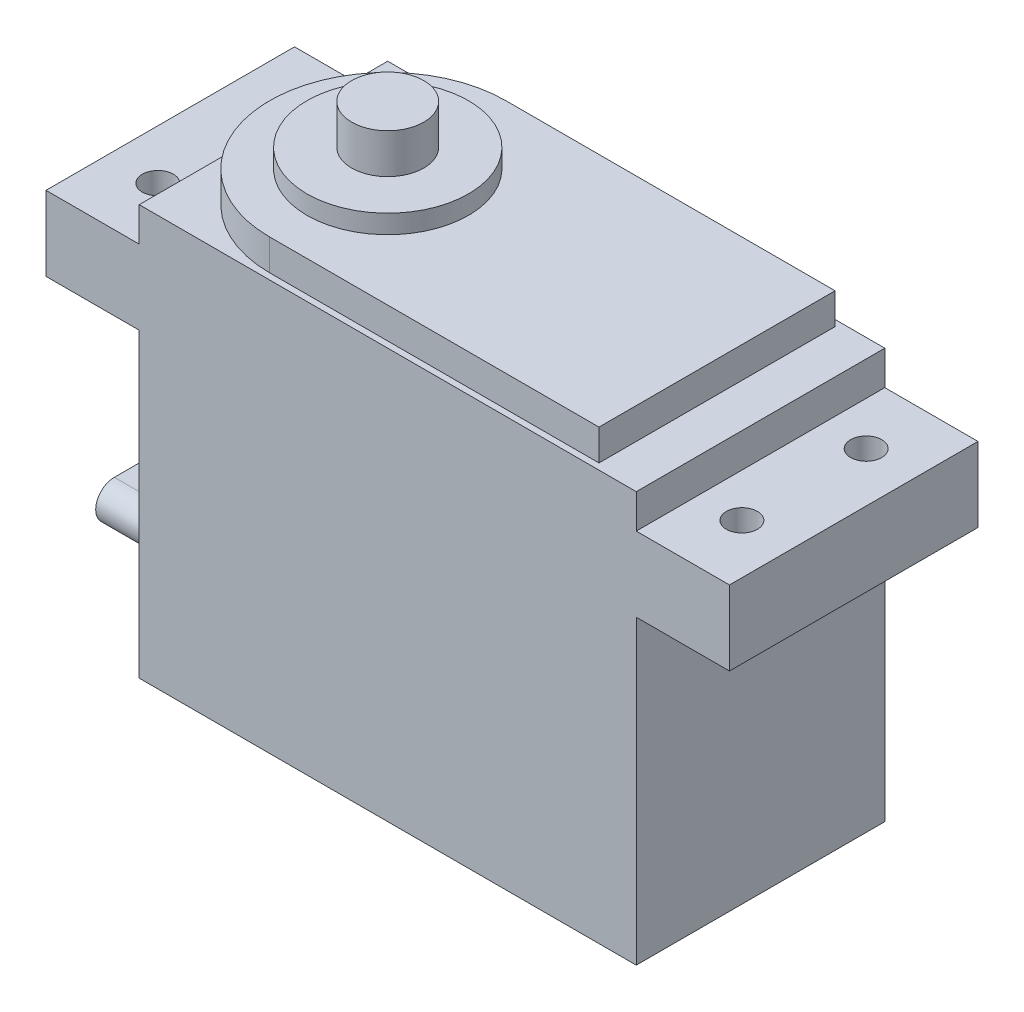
from build123d import *

# Parameters (mm, degrees)
EXTRUSION1_DEPTH        = 20
ESQUISSE2_R             = 1.25
ENL_V_MAT_EXTRU_1_DEPTH = 60.760459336
EXTRUSION2_DEPTH        = 2.5
ESQUISSE4_R             = 6.5
EXTRUSION3_DEPTH        = 1.5
ESQUISSE5_R             = 2.9
EXTRUSION4_DEPTH        = 3.2
EXTRUSION5_DEPTH        = 0.5
EXTRUSION6_DEPTH        = 10


with BuildPart() as part:
    # Esquisse1 → Extrusion1 (new body)
    with BuildSketch(Plane.XY):
        Polygon((47.5, 30.25), (40, 30.25), (40, 33), (0, 33), (0, 30.25), (-7.5, 30.25), (-7.5, 24.25), (0, 24.25), (0, 0), (40, 0), (40, 24.25), (47.5, 24.25), align=None)
    extrude(amount=EXTRUSION1_DEPTH)

    # Esquisse2 → Enl_v. mat.-Extru.1 (cut, through all)
    with BuildSketch(Plane(origin=(0, 30.25, 0), x_dir=(1, 0, 0), z_dir=(0, 1, 0))):
        with Locations(Location((-3.5, -5, 0), (0, 0, 270))):
            Circle(ESQUISSE2_R)
        with Locations(Location((-3.5, -15, 0), (0, 0, 270))):
            Circle(ESQUISSE2_R)
        with Locations(Location((43.5, -15, 0), (0, 0, 270))):
            Circle(ESQUISSE2_R)
        with Locations(Location((43.5, -5, 0), (0, 0, 270))):
            Circle(ESQUISSE2_R)
    extrude(amount=-ENL_V_MAT_EXTRU_1_DEPTH, mode=Mode.SUBTRACT)

    # Esquisse3 → Extrusion2 (add)
    with BuildSketch(Plane(origin=(0, 33, 0), x_dir=(1, 0, 0), z_dir=(0, 1, 0))):
        with BuildLine():
            Line((10, -0.5), (36.5, -0.5))
            Line((36.5, -0.5), (36.5, -19.5))
            Line((36.5, -19.5), (10, -19.5))
            ThreePointArc((10, -19.5), (0.5, -10), (10, -0.5))
        make_face()
    extrude(amount=EXTRUSION2_DEPTH)

    # Esquisse4 → Extrusion3 (add)
    with BuildSketch(Plane(origin=(0, 35.5, 0), x_dir=(1, 0, 0), z_dir=(0, 1, 0))):
        with Locations(Location((10, -10, 0), (0, 0, 270))):
            Circle(ESQUISSE4_R)
    extrude(amount=EXTRUSION3_DEPTH)

    # Esquisse5 → Extrusion4 (add)
    with BuildSketch(Plane(origin=(0, 37, 0), x_dir=(1, 0, 0), z_dir=(0, 1, 0))):
        with Locations(Location((10, -10, 0), (0, 0, 270))):
            Circle(ESQUISSE5_R)
    extrude(amount=EXTRUSION4_DEPTH)

    # Esquisse6 → Extrusion5 (add)
    with BuildSketch(Plane.ZY):
        with BuildLine():
            Line((9.5, 5), (11.5, 5))
            ThreePointArc((11.5, 5), (13.5, 3), (11.5, 1))
            Line((11.5, 1), (9.5, 1))
            ThreePointArc((9.5, 1), (7.5, 3), (9.5, 5))
        make_face()
    extrude(amount=EXTRUSION5_DEPTH)

    # Esquisse7 → Extrusion6 (add)
    with BuildSketch(Plane.ZY.offset(0.5)):
        with BuildLine():
            Line((9.5, 1.5), (11.5, 1.5))
            ThreePointArc((11.5, 1.5), (13, 3), (11.5, 4.5))
            Line((11.5, 4.5), (9.5, 4.5))
            ThreePointArc((9.5, 4.5), (8, 3), (9.5, 1.5))
        make_face()
    extrude(amount=EXTRUSION6_DEPTH)


solid = part.part
